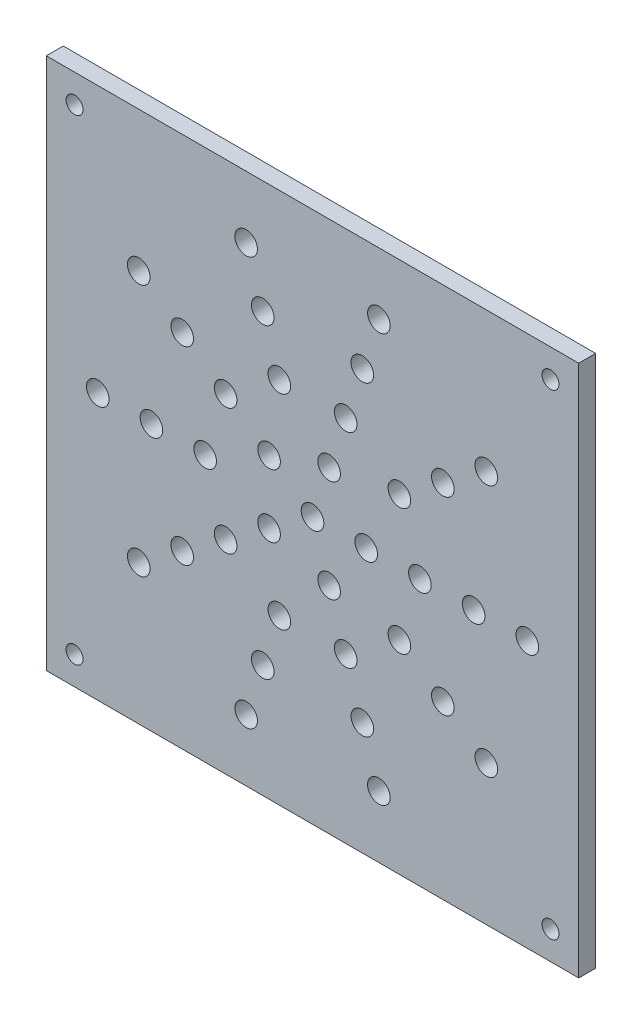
from build123d import *

# Parameters (mm, degrees)
ESQUISSE1_W        = 94.2
ESQUISSE1_H        = 94.2
ESQUISSE1_R        = 1.5
ESQUISSE1_R_2      = 2
BOSS_EXTRU_1_DEPTH = 3


with BuildPart() as part:
    # Esquisse1 → Boss.-Extru.1 (new body)
    with BuildSketch(Plane.XY):
        with Locations((42.1, -42.1)):
            Rectangle(ESQUISSE1_W, ESQUISSE1_H)
        Circle(ESQUISSE1_R, mode=Mode.SUBTRACT)
        with Locations((0, -84.2)):
            Circle(ESQUISSE1_R, mode=Mode.SUBTRACT)
        with Locations((84.2, -84.2)):
            Circle(ESQUISSE1_R, mode=Mode.SUBTRACT)
        with Locations((84.2, 0)):
            Circle(ESQUISSE1_R, mode=Mode.SUBTRACT)
        with Locations((42.1, -42.1)):
            Circle(ESQUISSE1_R_2, mode=Mode.SUBTRACT)
        with Locations((51.6, -42.1)):
            Circle(ESQUISSE1_R_2, mode=Mode.SUBTRACT)
        with Locations((61.1, -42.1)):
            Circle(ESQUISSE1_R_2, mode=Mode.SUBTRACT)
        with Locations((70.6, -42.1)):
            Circle(ESQUISSE1_R_2, mode=Mode.SUBTRACT)
        with Locations((80.1, -42.1)):
            Circle(ESQUISSE1_R_2, mode=Mode.SUBTRACT)
        with Locations((57.471322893, -53.267919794)):
            Circle(ESQUISSE1_R_2, mode=Mode.SUBTRACT)
        with Locations((65.15698434, -58.85187969)):
            Circle(ESQUISSE1_R_2, mode=Mode.SUBTRACT)
        with Locations((72.842645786, -64.435839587)):
            Circle(ESQUISSE1_R_2, mode=Mode.SUBTRACT)
        with Locations((45.035661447, -51.135036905)):
            Circle(ESQUISSE1_R_2, mode=Mode.SUBTRACT)
        with Locations((47.971322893, -60.17007381)):
            Circle(ESQUISSE1_R_2, mode=Mode.SUBTRACT)
        with Locations((50.90698434, -69.205110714)):
            Circle(ESQUISSE1_R_2, mode=Mode.SUBTRACT)
        with Locations((53.842645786, -78.240147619)):
            Circle(ESQUISSE1_R_2, mode=Mode.SUBTRACT)
        with Locations((36.228677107, -60.17007381)):
            Circle(ESQUISSE1_R_2, mode=Mode.SUBTRACT)
        with Locations((33.29301566, -69.205110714)):
            Circle(ESQUISSE1_R_2, mode=Mode.SUBTRACT)
        with Locations((30.357354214, -78.240147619)):
            Circle(ESQUISSE1_R_2, mode=Mode.SUBTRACT)
        with Locations((34.414338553, -47.683959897)):
            Circle(ESQUISSE1_R_2, mode=Mode.SUBTRACT)
        with Locations((26.728677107, -53.267919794)):
            Circle(ESQUISSE1_R_2, mode=Mode.SUBTRACT)
        with Locations((19.04301566, -58.85187969)):
            Circle(ESQUISSE1_R_2, mode=Mode.SUBTRACT)
        with Locations((11.357354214, -64.435839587)):
            Circle(ESQUISSE1_R_2, mode=Mode.SUBTRACT)
        with Locations((23.1, -42.1)):
            Circle(ESQUISSE1_R_2, mode=Mode.SUBTRACT)
        with Locations((13.6, -42.1)):
            Circle(ESQUISSE1_R_2, mode=Mode.SUBTRACT)
        with Locations((4.1, -42.1)):
            Circle(ESQUISSE1_R_2, mode=Mode.SUBTRACT)
        with Locations((34.414338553, -36.516040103)):
            Circle(ESQUISSE1_R_2, mode=Mode.SUBTRACT)
        with Locations((26.728677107, -30.932080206)):
            Circle(ESQUISSE1_R_2, mode=Mode.SUBTRACT)
        with Locations((19.04301566, -25.34812031)):
            Circle(ESQUISSE1_R_2, mode=Mode.SUBTRACT)
        with Locations((11.357354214, -19.764160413)):
            Circle(ESQUISSE1_R_2, mode=Mode.SUBTRACT)
        with Locations((36.228677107, -24.02992619)):
            Circle(ESQUISSE1_R_2, mode=Mode.SUBTRACT)
        with Locations((33.29301566, -14.994889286)):
            Circle(ESQUISSE1_R_2, mode=Mode.SUBTRACT)
        with Locations((30.357354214, -5.959852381)):
            Circle(ESQUISSE1_R_2, mode=Mode.SUBTRACT)
        with Locations((45.035661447, -33.064963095)):
            Circle(ESQUISSE1_R_2, mode=Mode.SUBTRACT)
        with Locations((47.971322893, -24.02992619)):
            Circle(ESQUISSE1_R_2, mode=Mode.SUBTRACT)
        with Locations((50.90698434, -14.994889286)):
            Circle(ESQUISSE1_R_2, mode=Mode.SUBTRACT)
        with Locations((53.842645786, -5.959852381)):
            Circle(ESQUISSE1_R_2, mode=Mode.SUBTRACT)
        with Locations((57.471322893, -30.932080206)):
            Circle(ESQUISSE1_R_2, mode=Mode.SUBTRACT)
        with Locations((65.15698434, -25.34812031)):
            Circle(ESQUISSE1_R_2, mode=Mode.SUBTRACT)
        with Locations((72.842645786, -19.764160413)):
            Circle(ESQUISSE1_R_2, mode=Mode.SUBTRACT)
    extrude(amount=BOSS_EXTRU_1_DEPTH)


solid = part.part
